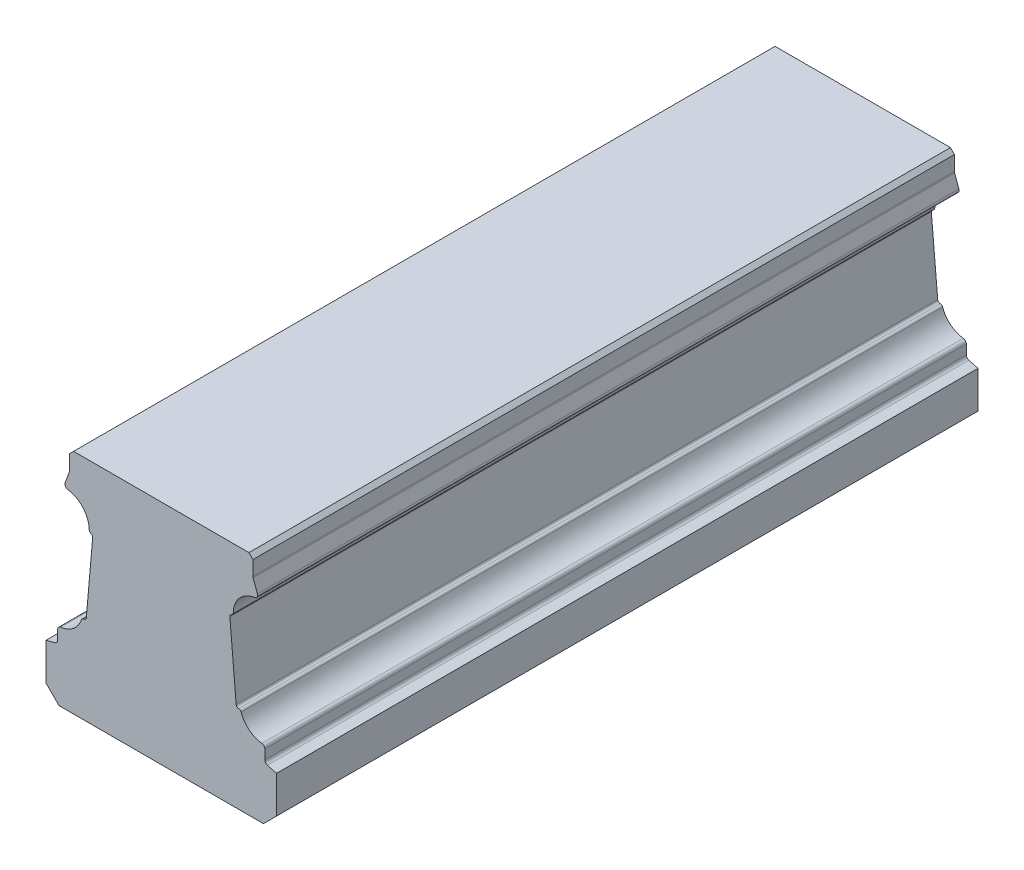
from build123d import *

# Parameters (mm, degrees)
AUFSATZ_LINEAR_AUSTRAGEN1_DEPTH = 70


with BuildPart() as part:
    # Skizze1 → Aufsatz-Linear austragen1 (new body)
    with BuildSketch(Plane.XY):
        with BuildLine():
            Line((7.478977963, 8.938468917), (6.843977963, 16.196552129))
            ThreePointArc((6.843977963, 16.196552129), (6.883697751, 16.357739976), (7.013670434, 16.461017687))
            ThreePointArc((7.013670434, 16.461017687), (7.136205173, 16.553335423), (7.184308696, 16.699017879))
            ThreePointArc((7.184308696, 16.699017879), (7.805060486, 18.296262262), (9.316712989, 19.103373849))
            ThreePointArc((9.316712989, 19.103373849), (9.564004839, 19.265972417), (9.592670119, 19.56053965))
            Line((9.592670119, 19.56053965), (9.170685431, 20.719933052))
            ThreePointArc((9.170685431, 20.719933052), (9.155210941, 20.777684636), (9.15, 20.837245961))
            Line((9.15, 20.837245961), (9.15, 22.3))
            Line((9.15, 22.3), (8.75, 22.7))
            Line((8.75, 22.7), (-6.25, 22.7))
            Line((-6.25, 22.7), (-8.75, 22.7))
            Line((-8.75, 22.7), (-9.15, 22.3))
            Line((-9.15, 22.3), (-9.15, 20.837245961))
            ThreePointArc((-9.15, 20.837245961), (-9.155210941, 20.777684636), (-9.170685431, 20.719933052))
            Line((-9.170685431, 20.719933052), (-9.592670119, 19.56053965))
            ThreePointArc((-9.592670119, 19.56053965), (-9.564004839, 19.265972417), (-9.316712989, 19.103373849))
            ThreePointArc((-9.316712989, 19.103373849), (-7.805060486, 18.296262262), (-7.184308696, 16.699017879))
            ThreePointArc((-7.184308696, 16.699017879), (-7.136205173, 16.553335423), (-7.013670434, 16.461017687))
            ThreePointArc((-7.013670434, 16.461017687), (-6.883697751, 16.357739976), (-6.843977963, 16.196552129))
            Line((-6.843977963, 16.196552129), (-7.478977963, 8.938468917))
            ThreePointArc((-7.478977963, 8.938468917), (-7.559976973, 8.77267671), (-7.731199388, 8.703896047))
            ThreePointArc((-7.731199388, 8.703896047), (-7.879127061, 8.654354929), (-7.971147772, 8.528382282))
            ThreePointArc((-7.971147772, 8.528382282), (-8.757741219, 7.393845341), (-10.030830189, 6.859853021))
            ThreePointArc((-10.030830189, 6.859853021), (-10.247898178, 6.747454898), (-10.335, 6.519058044))
            Line((-10.335, 6.519058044), (-10.335, 5.575353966))
            ThreePointArc((-10.335, 5.575353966), (-10.405879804, 5.366548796), (-10.589225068, 5.244041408))
            Line((-10.589225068, 5.244041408), (-11.5, 5))
            Line((-11.5, 5), (-11.5, 1.3))
            Line((-11.5, 1.3), (-10.2, 0))
            Line((-10.2, 0), (10.2, 0))
            Line((10.2, 0), (11.5, 1.3))
            Line((11.5, 1.3), (11.5, 5))
            Line((11.5, 5), (10.589225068, 5.244041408))
            ThreePointArc((10.589225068, 5.244041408), (10.405879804, 5.366548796), (10.335, 5.575353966))
            Line((10.335, 5.575353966), (10.335, 6.519058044))
            ThreePointArc((10.335, 6.519058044), (10.247898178, 6.747454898), (10.030830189, 6.859853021))
            ThreePointArc((10.030830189, 6.859853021), (8.757741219, 7.393845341), (7.971147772, 8.528382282))
            ThreePointArc((7.971147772, 8.528382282), (7.879127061, 8.654354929), (7.731199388, 8.703896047))
            ThreePointArc((7.731199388, 8.703896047), (7.559976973, 8.77267671), (7.478977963, 8.938468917))
        make_face()
    extrude(amount=AUFSATZ_LINEAR_AUSTRAGEN1_DEPTH)


solid = part.part
